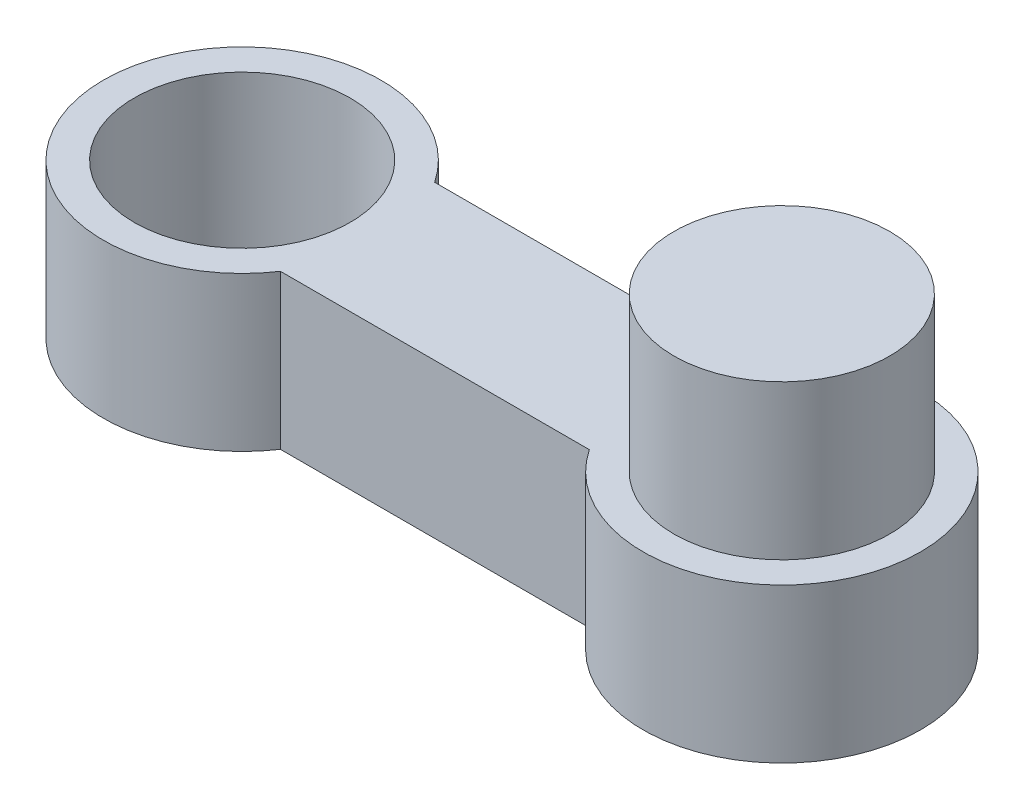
from build123d import *

# Parameters (mm, degrees)
BOSS_EXTRUDE1_DEPTH = 100
SKETCH2_R           = 70
CUT_EXTRUDE1_DEPTH  = 100
SKETCH3_R           = 70
BOSS_EXTRUDE2_DEPTH = 100


with BuildPart() as part:
    # Sketch1 → Boss-Extrude1 (new body)
    with BuildSketch(Plane(origin=(0, 0, 0), x_dir=(1, 0, 0), z_dir=(0, 1, 0))):
        with BuildLine():
            Line((-242.625717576, 275.741810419), (-242.625717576, 275.992438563))
            Line((-242.625717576, 275.992438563), (-42.625717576, 275.992438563))
            Line((-42.625717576, 275.992438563), (-42.625717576, 275.741810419))
            ThreePointArc((-42.625717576, 275.741810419), (122.374282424, 225.992438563), (-42.625717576, 176.243066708))
            Line((-42.625717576, 176.243066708), (-42.625717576, 175.992438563))
            Line((-42.625717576, 175.992438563), (-242.625717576, 175.992438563))
            Line((-242.625717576, 175.992438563), (-242.625717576, 176.243066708))
            ThreePointArc((-242.625717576, 176.243066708), (-407.625717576, 225.992438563), (-242.625717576, 275.741810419))
        make_face()
    extrude(amount=BOSS_EXTRUDE1_DEPTH)

    # Sketch2 → Cut-Extrude1 (cut)
    with BuildSketch(Plane(origin=(0, 100, 0), x_dir=(1, 0, 0), z_dir=(0, 1, 0))):
        with Locations(Location((-317.625717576, 225.992438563, 0), (0, 0, 270))):
            Circle(SKETCH2_R)
    extrude(amount=-CUT_EXTRUDE1_DEPTH, mode=Mode.SUBTRACT)

    # Sketch3 → Boss-Extrude2 (add)
    with BuildSketch(Plane(origin=(0, 100, 0), x_dir=(1, 0, 0), z_dir=(0, 1, 0))):
        with Locations(Location((32.374282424, 225.992438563, 0), (0, 0, 270))):
            Circle(SKETCH3_R)
    extrude(amount=BOSS_EXTRUDE2_DEPTH)


solid = part.part
